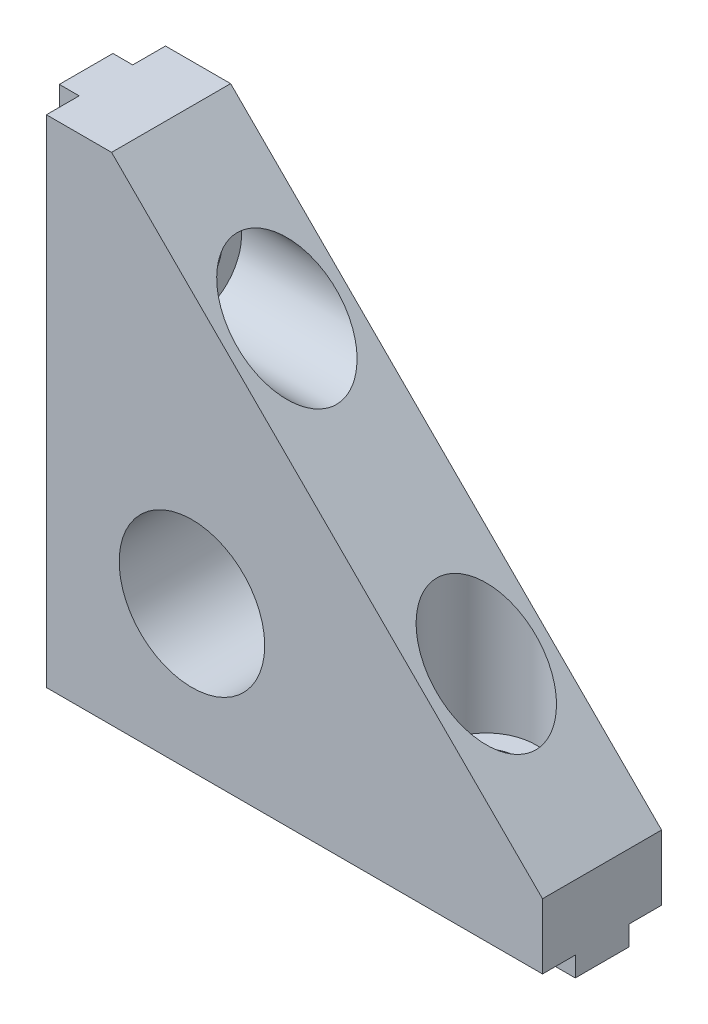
ISO-10303-21;
HEADER;
FILE_DESCRIPTION(('STEP AP214'),'2;1');
FILE_NAME('part.step','',(''),(''),'','','');
FILE_SCHEMA(('AUTOMOTIVE_DESIGN { 1 0 10303 214 1 1 1 1 }'));
ENDSEC;
DATA;
#1=APPLICATION_CONTEXT('core data for automotive mechanical design processes');
#2=APPLICATION_PROTOCOL_DEFINITION('international standard','automotive_design',2000,#1);
#3=PRODUCT_CONTEXT('',#1,'mechanical');
#4=PRODUCT('Part','Part','',(#3));
#5=PRODUCT_RELATED_PRODUCT_CATEGORY('part','',(#4));
#6=PRODUCT_DEFINITION_FORMATION('','',#4);
#7=PRODUCT_DEFINITION_CONTEXT('part definition',#1,'design');
#8=PRODUCT_DEFINITION('design','',#6,#7);
#9=PRODUCT_DEFINITION_SHAPE('','',#8);
#10=(LENGTH_UNIT() NAMED_UNIT(*) SI_UNIT(.MILLI.,.METRE.));
#11=(NAMED_UNIT(*) PLANE_ANGLE_UNIT() SI_UNIT($,.RADIAN.));
#12=(NAMED_UNIT(*) SI_UNIT($,.STERADIAN.) SOLID_ANGLE_UNIT());
#13=UNCERTAINTY_MEASURE_WITH_UNIT(LENGTH_MEASURE(1.E-05),#10,'distance_accuracy_value','');
#14=(GEOMETRIC_REPRESENTATION_CONTEXT(3) GLOBAL_UNCERTAINTY_ASSIGNED_CONTEXT((#13)) GLOBAL_UNIT_ASSIGNED_CONTEXT((#10,
#11,#12)) REPRESENTATION_CONTEXT('',''));
#15=CARTESIAN_POINT('',(0.,0.,0.));
#16=DIRECTION('',(0.,0.,1.));
#17=DIRECTION('',(1.,0.,0.));
#18=AXIS2_PLACEMENT_3D('',#15,#16,#17);
#19=CARTESIAN_POINT('',(53.,-25.,0.));
#20=DIRECTION('',(0.,-1.,0.));
#21=DIRECTION('',(0.,0.,-1.));
#22=AXIS2_PLACEMENT_3D('',#19,#20,#21);
#23=PLANE('',#22);
#24=DIRECTION('',(0.,0.,1.));
#25=VECTOR('',#24,1.);
#26=CARTESIAN_POINT('',(-19.,-25.,0.));
#27=LINE('',#26,#25);
#28=CARTESIAN_POINT('',(-19.,-25.,-4.05));
#29=VERTEX_POINT('',#28);
#30=CARTESIAN_POINT('',(-19.,-25.,4.05));
#31=VERTEX_POINT('',#30);
#32=EDGE_CURVE('E152',#29,#31,#27,.T.);
#33=ORIENTED_EDGE('',*,*,#32,.F.);
#34=DIRECTION('',(1.,0.,0.));
#35=VECTOR('',#34,1.);
#36=CARTESIAN_POINT('',(53.,-25.,-4.05));
#37=LINE('',#36,#35);
#38=CARTESIAN_POINT('',(33.5384954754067,-25.,-4.05));
#39=VERTEX_POINT('',#38);
#40=EDGE_CURVE('E138',#29,#39,#37,.T.);
#41=ORIENTED_EDGE('',*,*,#40,.T.);
#42=CARTESIAN_POINT('',(35.5,-25.,0.));
#43=DIRECTION('',(0.,1.,0.));
#44=DIRECTION('',(0.,0.,1.));
#45=AXIS2_PLACEMENT_3D('',#42,#43,#44);
#46=CIRCLE('',#45,4.5);
#47=CARTESIAN_POINT('',(33.5384954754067,-25.,4.05));
#48=VERTEX_POINT('',#47);
#49=EDGE_CURVE('E157',#39,#48,#46,.T.);
#50=ORIENTED_EDGE('',*,*,#49,.T.);
#51=DIRECTION('',(-1.,0.,0.));
#52=VECTOR('',#51,1.);
#53=CARTESIAN_POINT('',(53.,-25.,4.05));
#54=LINE('',#53,#52);
#55=EDGE_CURVE('E145',#48,#31,#54,.T.);
#56=ORIENTED_EDGE('',*,*,#55,.T.);
#57=EDGE_LOOP('',(#33,#41,#50,#56));
#58=FACE_BOUND('',#57,.T.);
#59=ADVANCED_FACE('F15',(#58),#23,.T.);
#60=CARTESIAN_POINT('',(53.,-25.,4.05));
#61=DIRECTION('',(0.,0.,-1.));
#62=DIRECTION('',(-1.,0.,0.));
#63=AXIS2_PLACEMENT_3D('',#60,#61,#62);
#64=PLANE('',#63);
#65=DIRECTION('',(1.,0.,0.));
#66=VECTOR('',#65,1.);
#67=CARTESIAN_POINT('',(53.,-22.,4.05));
#68=LINE('',#67,#66);
#69=CARTESIAN_POINT('',(33.5384954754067,-22.,4.05));
#70=VERTEX_POINT('',#69);
#71=CARTESIAN_POINT('',(-22.,-22.,4.05));
#72=VERTEX_POINT('',#71);
#73=EDGE_CURVE('E161',#70,#72,#68,.F.);
#74=ORIENTED_EDGE('',*,*,#73,.T.);
#75=DIRECTION('',(0.707106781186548,-0.707106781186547,0.));
#76=VECTOR('',#75,1.);
#77=CARTESIAN_POINT('',(-19.,-25.,4.05));
#78=LINE('',#77,#76);
#79=EDGE_CURVE('E151',#31,#72,#78,.F.);
#80=ORIENTED_EDGE('',*,*,#79,.F.);
#81=ORIENTED_EDGE('',*,*,#55,.F.);
#82=DIRECTION('',(0.,1.,0.));
#83=VECTOR('',#82,1.);
#84=CARTESIAN_POINT('',(33.5384954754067,-17.,4.05));
#85=LINE('',#84,#83);
#86=EDGE_CURVE('E149',#48,#70,#85,.T.);
#87=ORIENTED_EDGE('',*,*,#86,.T.);
#88=EDGE_LOOP('',(#74,#80,#81,#87));
#89=FACE_BOUND('',#88,.T.);
#90=ADVANCED_FACE('F148',(#89),#64,.F.);
#91=CARTESIAN_POINT('',(35.5,-9.,0.));
#92=DIRECTION('',(0.,1.,0.));
#93=DIRECTION('',(0.,0.,1.));
#94=AXIS2_PLACEMENT_3D('',#91,#92,#93);
#95=PLANE('',#94);
#96=CARTESIAN_POINT('',(35.5000000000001,-9.,0.));
#97=DIRECTION('',(0.,1.,0.));
#98=DIRECTION('',(0.,0.,1.));
#99=AXIS2_PLACEMENT_3D('',#96,#97,#98);
#100=CIRCLE('',#99,4.5);
#101=CARTESIAN_POINT('',(35.5000000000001,-9.00000000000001,4.50000000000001));
#102=VERTEX_POINT('',#101);
#103=EDGE_CURVE('E19',#102,#102,#100,.F.);
#104=ORIENTED_EDGE('',*,*,#103,.T.);
#105=EDGE_LOOP('',(#104));
#106=FACE_BOUND('',#105,.T.);
#107=CARTESIAN_POINT('',(35.5,-8.99999999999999,0.));
#108=DIRECTION('',(0.,1.,0.));
#109=DIRECTION('',(-1.,0.,0.));
#110=AXIS2_PLACEMENT_3D('',#107,#108,#109);
#111=CIRCLE('',#110,7.5);
#112=CARTESIAN_POINT('',(28.,-9.,0.));
#113=VERTEX_POINT('',#112);
#114=EDGE_CURVE('E172',#113,#113,#111,.T.);
#115=ORIENTED_EDGE('',*,*,#114,.T.);
#116=EDGE_LOOP('',(#115));
#117=FACE_BOUND('',#116,.T.);
#118=ADVANCED_FACE('F488',(#106,#117),#95,.T.);
#119=CARTESIAN_POINT('',(-19.,-25.,0.));
#120=DIRECTION('',(-0.707106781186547,-0.707106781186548,0.));
#121=DIRECTION('',(0.707106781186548,-0.707106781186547,0.));
#122=AXIS2_PLACEMENT_3D('',#119,#120,#121);
#123=PLANE('',#122);
#124=ORIENTED_EDGE('',*,*,#32,.T.);
#125=ORIENTED_EDGE('',*,*,#79,.T.);
#126=DIRECTION('',(-0.707106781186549,0.707106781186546,0.));
#127=VECTOR('',#126,1.);
#128=CARTESIAN_POINT('',(-22.,-22.,4.05));
#129=LINE('',#128,#127);
#130=CARTESIAN_POINT('',(-25.,-19.0000000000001,4.05));
#131=VERTEX_POINT('',#130);
#132=EDGE_CURVE('E250',#72,#131,#129,.T.);
#133=ORIENTED_EDGE('',*,*,#132,.T.);
#134=DIRECTION('',(0.,0.,1.));
#135=VECTOR('',#134,1.);
#136=CARTESIAN_POINT('',(-25.,-19.0000000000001,0.));
#137=LINE('',#136,#135);
#138=CARTESIAN_POINT('',(-25.,-19.,-4.05));
#139=VERTEX_POINT('',#138);
#140=EDGE_CURVE('E219',#139,#131,#137,.T.);
#141=ORIENTED_EDGE('',*,*,#140,.F.);
#142=DIRECTION('',(0.707106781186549,-0.707106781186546,0.));
#143=VECTOR('',#142,1.);
#144=CARTESIAN_POINT('',(-25.,-19.0000000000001,-4.05));
#145=LINE('',#144,#143);
#146=CARTESIAN_POINT('',(-22.,-22.,-4.05));
#147=VERTEX_POINT('',#146);
#148=EDGE_CURVE('E261',#139,#147,#145,.T.);
#149=ORIENTED_EDGE('',*,*,#148,.T.);
#150=DIRECTION('',(0.70710678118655,-0.707106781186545,0.));
#151=VECTOR('',#150,1.);
#152=CARTESIAN_POINT('',(-22.,-22.,-4.05));
#153=LINE('',#152,#151);
#154=EDGE_CURVE('E221',#147,#29,#153,.T.);
#155=ORIENTED_EDGE('',*,*,#154,.T.);
#156=EDGE_LOOP('',(#124,#125,#133,#141,#149,#155));
#157=FACE_BOUND('',#156,.T.);
#158=ADVANCED_FACE('F381',(#157),#123,.T.);
#159=CARTESIAN_POINT('',(-9.00000000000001,35.5,0.));
#160=DIRECTION('',(1.,0.,0.));
#161=DIRECTION('',(0.,0.,-1.));
#162=AXIS2_PLACEMENT_3D('',#159,#160,#161);
#163=PLANE('',#162);
#164=CARTESIAN_POINT('',(-9.00000000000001,35.5,0.));
#165=DIRECTION('',(1.,0.,0.));
#166=DIRECTION('',(0.,1.,0.));
#167=AXIS2_PLACEMENT_3D('',#164,#165,#166);
#168=CIRCLE('',#167,4.5);
#169=CARTESIAN_POINT('',(-9.00000000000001,40.,0.));
#170=VERTEX_POINT('',#169);
#171=EDGE_CURVE('E180',#170,#170,#168,.F.);
#172=ORIENTED_EDGE('',*,*,#171,.T.);
#173=EDGE_LOOP('',(#172));
#174=FACE_BOUND('',#173,.T.);
#175=CARTESIAN_POINT('',(-9.00000000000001,35.5,0.));
#176=DIRECTION('',(1.,0.,0.));
#177=DIRECTION('',(0.,1.,0.));
#178=AXIS2_PLACEMENT_3D('',#175,#176,#177);
#179=CIRCLE('',#178,7.5);
#180=CARTESIAN_POINT('',(-9.00000000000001,43.,0.));
#181=VERTEX_POINT('',#180);
#182=EDGE_CURVE('E175',#181,#181,#179,.T.);
#183=ORIENTED_EDGE('',*,*,#182,.T.);
#184=EDGE_LOOP('',(#183));
#185=FACE_BOUND('',#184,.T.);
#186=ADVANCED_FACE('F416',(#174,#185),#163,.T.);
#187=CARTESIAN_POINT('',(-25.,-19.,0.));
#188=DIRECTION('',(-1.,0.,0.));
#189=DIRECTION('',(0.,0.,1.));
#190=AXIS2_PLACEMENT_3D('',#187,#188,#189);
#191=PLANE('',#190);
#192=ORIENTED_EDGE('',*,*,#140,.T.);
#193=DIRECTION('',(0.,1.,0.));
#194=VECTOR('',#193,1.);
#195=CARTESIAN_POINT('',(-25.,53.,4.05));
#196=LINE('',#195,#194);
#197=CARTESIAN_POINT('',(-25.,33.5384954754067,4.05));
#198=VERTEX_POINT('',#197);
#199=EDGE_CURVE('E253',#131,#198,#196,.T.);
#200=ORIENTED_EDGE('',*,*,#199,.T.);
#201=CARTESIAN_POINT('',(-25.,35.5,0.));
#202=DIRECTION('',(1.,0.,0.));
#203=DIRECTION('',(0.,1.,0.));
#204=AXIS2_PLACEMENT_3D('',#201,#202,#203);
#205=CIRCLE('',#204,4.5);
#206=CARTESIAN_POINT('',(-25.,33.5384954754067,-4.05));
#207=VERTEX_POINT('',#206);
#208=EDGE_CURVE('E183',#198,#207,#205,.T.);
#209=ORIENTED_EDGE('',*,*,#208,.T.);
#210=DIRECTION('',(0.,1.,0.));
#211=VECTOR('',#210,1.);
#212=CARTESIAN_POINT('',(-25.,53.,-4.05));
#213=LINE('',#212,#211);
#214=EDGE_CURVE('E258',#207,#139,#213,.F.);
#215=ORIENTED_EDGE('',*,*,#214,.T.);
#216=EDGE_LOOP('',(#192,#200,#209,#215));
#217=FACE_BOUND('',#216,.T.);
#218=ADVANCED_FACE('F414',(#217),#191,.T.);
#219=CARTESIAN_POINT('',(-22.,53.,4.05));
#220=DIRECTION('',(0.,0.,-1.));
#221=DIRECTION('',(-1.,0.,0.));
#222=AXIS2_PLACEMENT_3D('',#219,#220,#221);
#223=PLANE('',#222);
#224=ORIENTED_EDGE('',*,*,#199,.F.);
#225=ORIENTED_EDGE('',*,*,#132,.F.);
#226=DIRECTION('',(0.,1.,0.));
#227=VECTOR('',#226,1.);
#228=CARTESIAN_POINT('',(-22.,53.,4.05));
#229=LINE('',#228,#227);
#230=CARTESIAN_POINT('',(-22.,33.5384954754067,4.05));
#231=VERTEX_POINT('',#230);
#232=EDGE_CURVE('E249',#72,#231,#229,.T.);
#233=ORIENTED_EDGE('',*,*,#232,.T.);
#234=DIRECTION('',(-1.,0.,0.));
#235=VECTOR('',#234,1.);
#236=CARTESIAN_POINT('',(-17.,33.5384954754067,4.05));
#237=LINE('',#236,#235);
#238=EDGE_CURVE('E196',#231,#198,#237,.T.);
#239=ORIENTED_EDGE('',*,*,#238,.T.);
#240=EDGE_LOOP('',(#224,#225,#233,#239));
#241=FACE_BOUND('',#240,.T.);
#242=ADVANCED_FACE('F412',(#241),#223,.F.);
#243=CARTESIAN_POINT('',(53.,-22.,-4.05));
#244=DIRECTION('',(0.,0.,1.));
#245=DIRECTION('',(1.,0.,0.));
#246=AXIS2_PLACEMENT_3D('',#243,#244,#245);
#247=PLANE('',#246);
#248=ORIENTED_EDGE('',*,*,#40,.F.);
#249=ORIENTED_EDGE('',*,*,#154,.F.);
#250=DIRECTION('',(1.,0.,0.));
#251=VECTOR('',#250,1.);
#252=CARTESIAN_POINT('',(53.,-22.,-4.05));
#253=LINE('',#252,#251);
#254=CARTESIAN_POINT('',(33.5384954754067,-22.,-4.05));
#255=VERTEX_POINT('',#254);
#256=EDGE_CURVE('E201',#147,#255,#253,.T.);
#257=ORIENTED_EDGE('',*,*,#256,.T.);
#258=DIRECTION('',(0.,-1.,0.));
#259=VECTOR('',#258,1.);
#260=CARTESIAN_POINT('',(33.5384954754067,-17.,-4.05));
#261=LINE('',#260,#259);
#262=EDGE_CURVE('E163',#255,#39,#261,.T.);
#263=ORIENTED_EDGE('',*,*,#262,.T.);
#264=EDGE_LOOP('',(#248,#249,#257,#263));
#265=FACE_BOUND('',#264,.T.);
#266=ADVANCED_FACE('F379',(#265),#247,.F.);
#267=CARTESIAN_POINT('',(35.5,-25.,0.));
#268=DIRECTION('',(0.,1.,0.));
#269=DIRECTION('',(0.,0.,1.));
#270=AXIS2_PLACEMENT_3D('',#267,#268,#269);
#271=CYLINDRICAL_SURFACE('',#270,4.5);
#272=CARTESIAN_POINT('',(35.5,-22.,0.));
#273=DIRECTION('',(0.,1.,0.));
#274=DIRECTION('',(0.,0.,1.));
#275=AXIS2_PLACEMENT_3D('',#272,#273,#274);
#276=CIRCLE('',#275,4.5);
#277=CARTESIAN_POINT('',(37.4615045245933,-22.,4.05));
#278=VERTEX_POINT('',#277);
#279=EDGE_CURVE('E160',#278,#70,#276,.F.);
#280=ORIENTED_EDGE('',*,*,#279,.T.);
#281=ORIENTED_EDGE('',*,*,#86,.F.);
#282=ORIENTED_EDGE('',*,*,#49,.F.);
#283=ORIENTED_EDGE('',*,*,#262,.F.);
#284=CARTESIAN_POINT('',(35.5,-22.,0.));
#285=DIRECTION('',(0.,1.,0.));
#286=DIRECTION('',(0.,0.,1.));
#287=AXIS2_PLACEMENT_3D('',#284,#285,#286);
#288=CIRCLE('',#287,4.5);
#289=CARTESIAN_POINT('',(37.4615045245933,-22.,-4.05));
#290=VERTEX_POINT('',#289);
#291=EDGE_CURVE('E197',#255,#290,#288,.F.);
#292=ORIENTED_EDGE('',*,*,#291,.T.);
#293=DIRECTION('',(0.,1.,0.));
#294=VECTOR('',#293,1.);
#295=CARTESIAN_POINT('',(37.4615045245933,-22.,-4.05));
#296=LINE('',#295,#294);
#297=CARTESIAN_POINT('',(37.4615045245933,-25.,-4.05));
#298=VERTEX_POINT('',#297);
#299=EDGE_CURVE('E176',#290,#298,#296,.F.);
#300=ORIENTED_EDGE('',*,*,#299,.T.);
#301=CARTESIAN_POINT('',(35.5,-25.,0.));
#302=DIRECTION('',(0.,1.,0.));
#303=DIRECTION('',(0.,0.,1.));
#304=AXIS2_PLACEMENT_3D('',#301,#302,#303);
#305=CIRCLE('',#304,4.5);
#306=CARTESIAN_POINT('',(37.4615045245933,-25.,4.05));
#307=VERTEX_POINT('',#306);
#308=EDGE_CURVE('E168',#307,#298,#305,.T.);
#309=ORIENTED_EDGE('',*,*,#308,.F.);
#310=DIRECTION('',(0.,1.,0.));
#311=VECTOR('',#310,1.);
#312=CARTESIAN_POINT('',(37.4615045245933,-25.,4.05));
#313=LINE('',#312,#311);
#314=EDGE_CURVE('E171',#307,#278,#313,.T.);
#315=ORIENTED_EDGE('',*,*,#314,.T.);
#316=EDGE_LOOP('',(#280,#281,#282,#283,#292,#300,#309,#315));
#317=FACE_BOUND('',#316,.T.);
#318=ORIENTED_EDGE('',*,*,#103,.F.);
#319=EDGE_LOOP('',(#318));
#320=FACE_BOUND('',#319,.T.);
#321=ADVANCED_FACE('F155',(#317,#320),#271,.F.);
#322=CARTESIAN_POINT('',(53.,-22.,4.05));
#323=DIRECTION('',(0.,1.,0.));
#324=DIRECTION('',(0.,0.,1.));
#325=AXIS2_PLACEMENT_3D('',#322,#323,#324);
#326=PLANE('',#325);
#327=DIRECTION('',(-1.,0.,0.));
#328=VECTOR('',#327,1.);
#329=CARTESIAN_POINT('',(53.,-22.,4.05));
#330=LINE('',#329,#328);
#331=CARTESIAN_POINT('',(53.,-22.,4.05));
#332=VERTEX_POINT('',#331);
#333=EDGE_CURVE('E167',#278,#332,#330,.F.);
#334=ORIENTED_EDGE('',*,*,#333,.T.);
#335=DIRECTION('',(0.,0.,-1.));
#336=VECTOR('',#335,1.);
#337=CARTESIAN_POINT('',(53.,-22.,0.));
#338=LINE('',#337,#336);
#339=CARTESIAN_POINT('',(53.,-22.,9.));
#340=VERTEX_POINT('',#339);
#341=EDGE_CURVE('E200',#340,#332,#338,.T.);
#342=ORIENTED_EDGE('',*,*,#341,.F.);
#343=DIRECTION('',(1.,0.,0.));
#344=VECTOR('',#343,1.);
#345=CARTESIAN_POINT('',(5.77669301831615,-22.,9.));
#346=LINE('',#345,#344);
#347=CARTESIAN_POINT('',(-22.,-22.,9.));
#348=VERTEX_POINT('',#347);
#349=EDGE_CURVE('E239',#348,#340,#346,.T.);
#350=ORIENTED_EDGE('',*,*,#349,.F.);
#351=DIRECTION('',(0.,0.,-1.));
#352=VECTOR('',#351,1.);
#353=CARTESIAN_POINT('',(-22.,-22.,9.));
#354=LINE('',#353,#352);
#355=EDGE_CURVE('E246',#348,#72,#354,.T.);
#356=ORIENTED_EDGE('',*,*,#355,.T.);
#357=ORIENTED_EDGE('',*,*,#73,.F.);
#358=ORIENTED_EDGE('',*,*,#279,.F.);
#359=EDGE_LOOP('',(#334,#342,#350,#356,#357,#358));
#360=FACE_BOUND('',#359,.T.);
#361=ADVANCED_FACE('F365',(#360),#326,.F.);
#362=CARTESIAN_POINT('',(53.,-25.,4.05));
#363=DIRECTION('',(0.,0.,-1.));
#364=DIRECTION('',(-1.,0.,0.));
#365=AXIS2_PLACEMENT_3D('',#362,#363,#364);
#366=PLANE('',#365);
#367=DIRECTION('',(1.,0.,0.));
#368=VECTOR('',#367,1.);
#369=CARTESIAN_POINT('',(53.,-25.,4.05));
#370=LINE('',#369,#368);
#371=CARTESIAN_POINT('',(53.,-25.,4.05));
#372=VERTEX_POINT('',#371);
#373=EDGE_CURVE('E170',#372,#307,#370,.F.);
#374=ORIENTED_EDGE('',*,*,#373,.F.);
#375=DIRECTION('',(0.,1.,0.));
#376=VECTOR('',#375,1.);
#377=CARTESIAN_POINT('',(53.,-12.15,4.05));
#378=LINE('',#377,#376);
#379=EDGE_CURVE('E224',#332,#372,#378,.F.);
#380=ORIENTED_EDGE('',*,*,#379,.F.);
#381=ORIENTED_EDGE('',*,*,#333,.F.);
#382=ORIENTED_EDGE('',*,*,#314,.F.);
#383=EDGE_LOOP('',(#374,#380,#381,#382));
#384=FACE_BOUND('',#383,.T.);
#385=ADVANCED_FACE('F370',(#384),#366,.F.);
#386=CARTESIAN_POINT('',(53.,-25.,0.));
#387=DIRECTION('',(0.,-1.,0.));
#388=DIRECTION('',(0.,0.,-1.));
#389=AXIS2_PLACEMENT_3D('',#386,#387,#388);
#390=PLANE('',#389);
#391=DIRECTION('',(0.,0.,-1.));
#392=VECTOR('',#391,1.);
#393=CARTESIAN_POINT('',(53.,-25.,0.));
#394=LINE('',#393,#392);
#395=CARTESIAN_POINT('',(53.,-25.,-4.05));
#396=VERTEX_POINT('',#395);
#397=EDGE_CURVE('E228',#372,#396,#394,.T.);
#398=ORIENTED_EDGE('',*,*,#397,.F.);
#399=ORIENTED_EDGE('',*,*,#373,.T.);
#400=ORIENTED_EDGE('',*,*,#308,.T.);
#401=DIRECTION('',(1.,0.,0.));
#402=VECTOR('',#401,1.);
#403=CARTESIAN_POINT('',(53.,-25.,-4.05));
#404=LINE('',#403,#402);
#405=EDGE_CURVE('E232',#298,#396,#404,.T.);
#406=ORIENTED_EDGE('',*,*,#405,.T.);
#407=EDGE_LOOP('',(#398,#399,#400,#406));
#408=FACE_BOUND('',#407,.T.);
#409=ADVANCED_FACE('F374',(#408),#390,.T.);
#410=CARTESIAN_POINT('',(53.,-22.,-4.05));
#411=DIRECTION('',(0.,0.,1.));
#412=DIRECTION('',(1.,0.,0.));
#413=AXIS2_PLACEMENT_3D('',#410,#411,#412);
#414=PLANE('',#413);
#415=DIRECTION('',(1.,0.,0.));
#416=VECTOR('',#415,1.);
#417=CARTESIAN_POINT('',(53.,-22.,-4.05));
#418=LINE('',#417,#416);
#419=CARTESIAN_POINT('',(53.,-22.,-4.05));
#420=VERTEX_POINT('',#419);
#421=EDGE_CURVE('E242',#290,#420,#418,.T.);
#422=ORIENTED_EDGE('',*,*,#421,.T.);
#423=DIRECTION('',(0.,1.,0.));
#424=VECTOR('',#423,1.);
#425=CARTESIAN_POINT('',(53.,-12.15,-4.05));
#426=LINE('',#425,#424);
#427=EDGE_CURVE('E231',#396,#420,#426,.T.);
#428=ORIENTED_EDGE('',*,*,#427,.F.);
#429=ORIENTED_EDGE('',*,*,#405,.F.);
#430=ORIENTED_EDGE('',*,*,#299,.F.);
#431=EDGE_LOOP('',(#422,#428,#429,#430));
#432=FACE_BOUND('',#431,.T.);
#433=ADVANCED_FACE('F377',(#432),#414,.F.);
#434=CARTESIAN_POINT('',(35.5,-9.,0.));
#435=DIRECTION('',(0.,1.,0.));
#436=DIRECTION('',(-1.,0.,0.));
#437=AXIS2_PLACEMENT_3D('',#434,#435,#436);
#438=CYLINDRICAL_SURFACE('',#437,7.5);
#439=ORIENTED_EDGE('',*,*,#114,.F.);
#440=EDGE_LOOP('',(#439));
#441=FACE_BOUND('',#440,.T.);
#442=CARTESIAN_POINT('',(35.5,5.35000000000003,0.));
#443=DIRECTION('',(0.707106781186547,0.707106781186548,0.));
#444=DIRECTION('',(-0.707106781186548,0.707106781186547,0.));
#445=AXIS2_PLACEMENT_3D('',#442,#443,#444);
#446=ELLIPSE('',#445,10.6066017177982,7.5);
#447=CARTESIAN_POINT('',(28.,12.85,0.));
#448=VERTEX_POINT('',#447);
#449=EDGE_CURVE('E202',#448,#448,#446,.F.);
#450=ORIENTED_EDGE('',*,*,#449,.F.);
#451=EDGE_LOOP('',(#450));
#452=FACE_BOUND('',#451,.T.);
#453=ADVANCED_FACE('F464',(#441,#452),#438,.F.);
#454=CARTESIAN_POINT('',(-9.00000000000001,35.5,0.));
#455=DIRECTION('',(1.,0.,0.));
#456=DIRECTION('',(0.,1.,0.));
#457=AXIS2_PLACEMENT_3D('',#454,#455,#456);
#458=CYLINDRICAL_SURFACE('',#457,7.5);
#459=ORIENTED_EDGE('',*,*,#182,.F.);
#460=EDGE_LOOP('',(#459));
#461=FACE_BOUND('',#460,.T.);
#462=CARTESIAN_POINT('',(5.35000000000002,35.5,0.));
#463=DIRECTION('',(0.707106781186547,0.707106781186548,0.));
#464=DIRECTION('',(0.707106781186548,-0.707106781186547,0.));
#465=AXIS2_PLACEMENT_3D('',#462,#463,#464);
#466=ELLIPSE('',#465,10.6066017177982,7.5);
#467=CARTESIAN_POINT('',(12.85,28.,0.));
#468=VERTEX_POINT('',#467);
#469=EDGE_CURVE('E205',#468,#468,#466,.F.);
#470=ORIENTED_EDGE('',*,*,#469,.F.);
#471=EDGE_LOOP('',(#470));
#472=FACE_BOUND('',#471,.T.);
#473=ADVANCED_FACE('F461',(#461,#472),#458,.F.);
#474=CARTESIAN_POINT('',(-22.,53.,4.05));
#475=DIRECTION('',(0.,0.,-1.));
#476=DIRECTION('',(-1.,0.,0.));
#477=AXIS2_PLACEMENT_3D('',#474,#475,#476);
#478=PLANE('',#477);
#479=DIRECTION('',(0.,1.,0.));
#480=VECTOR('',#479,1.);
#481=CARTESIAN_POINT('',(-22.,53.,4.05));
#482=LINE('',#481,#480);
#483=CARTESIAN_POINT('',(-22.,37.4615045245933,4.05));
#484=VERTEX_POINT('',#483);
#485=CARTESIAN_POINT('',(-22.,53.,4.05));
#486=VERTEX_POINT('',#485);
#487=EDGE_CURVE('E179',#484,#486,#482,.T.);
#488=ORIENTED_EDGE('',*,*,#487,.T.);
#489=DIRECTION('',(1.,0.,0.));
#490=VECTOR('',#489,1.);
#491=CARTESIAN_POINT('',(-25.,53.,4.05));
#492=LINE('',#491,#490);
#493=CARTESIAN_POINT('',(-25.,53.,4.05));
#494=VERTEX_POINT('',#493);
#495=EDGE_CURVE('E209',#494,#486,#492,.T.);
#496=ORIENTED_EDGE('',*,*,#495,.F.);
#497=DIRECTION('',(0.,1.,0.));
#498=VECTOR('',#497,1.);
#499=CARTESIAN_POINT('',(-25.,-19.,4.05));
#500=LINE('',#499,#498);
#501=CARTESIAN_POINT('',(-25.,37.4615045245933,4.05));
#502=VERTEX_POINT('',#501);
#503=EDGE_CURVE('E262',#502,#494,#500,.T.);
#504=ORIENTED_EDGE('',*,*,#503,.F.);
#505=DIRECTION('',(1.,0.,0.));
#506=VECTOR('',#505,1.);
#507=CARTESIAN_POINT('',(-17.,37.4615045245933,4.05));
#508=LINE('',#507,#506);
#509=EDGE_CURVE('E191',#502,#484,#508,.T.);
#510=ORIENTED_EDGE('',*,*,#509,.T.);
#511=EDGE_LOOP('',(#488,#496,#504,#510));
#512=FACE_BOUND('',#511,.T.);
#513=ADVANCED_FACE('F402',(#512),#478,.F.);
#514=CARTESIAN_POINT('',(-22.,53.,9.));
#515=DIRECTION('',(1.,0.,0.));
#516=DIRECTION('',(0.,0.,-1.));
#517=AXIS2_PLACEMENT_3D('',#514,#515,#516);
#518=PLANE('',#517);
#519=ORIENTED_EDGE('',*,*,#232,.F.);
#520=ORIENTED_EDGE('',*,*,#355,.F.);
#521=DIRECTION('',(0.,1.,0.));
#522=VECTOR('',#521,1.);
#523=CARTESIAN_POINT('',(-22.,5.77669301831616,9.));
#524=LINE('',#523,#522);
#525=CARTESIAN_POINT('',(-22.,53.,9.));
#526=VERTEX_POINT('',#525);
#527=EDGE_CURVE('E243',#526,#348,#524,.F.);
#528=ORIENTED_EDGE('',*,*,#527,.F.);
#529=DIRECTION('',(0.,0.,1.));
#530=VECTOR('',#529,1.);
#531=CARTESIAN_POINT('',(-22.,53.,0.));
#532=LINE('',#531,#530);
#533=EDGE_CURVE('E235',#486,#526,#532,.T.);
#534=ORIENTED_EDGE('',*,*,#533,.F.);
#535=ORIENTED_EDGE('',*,*,#487,.F.);
#536=CARTESIAN_POINT('',(-22.,35.5,0.));
#537=DIRECTION('',(1.,0.,0.));
#538=DIRECTION('',(0.,1.,0.));
#539=AXIS2_PLACEMENT_3D('',#536,#537,#538);
#540=CIRCLE('',#539,4.5);
#541=EDGE_CURVE('E193',#484,#231,#540,.T.);
#542=ORIENTED_EDGE('',*,*,#541,.T.);
#543=EDGE_LOOP('',(#519,#520,#528,#534,#535,#542));
#544=FACE_BOUND('',#543,.T.);
#545=ADVANCED_FACE('F406',(#544),#518,.F.);
#546=CARTESIAN_POINT('',(-25.,-19.,0.));
#547=DIRECTION('',(-1.,0.,0.));
#548=DIRECTION('',(0.,0.,1.));
#549=AXIS2_PLACEMENT_3D('',#546,#547,#548);
#550=PLANE('',#549);
#551=DIRECTION('',(0.,0.,1.));
#552=VECTOR('',#551,1.);
#553=CARTESIAN_POINT('',(-25.,53.,0.));
#554=LINE('',#553,#552);
#555=CARTESIAN_POINT('',(-25.,53.,-4.05));
#556=VERTEX_POINT('',#555);
#557=EDGE_CURVE('E282',#556,#494,#554,.T.);
#558=ORIENTED_EDGE('',*,*,#557,.F.);
#559=DIRECTION('',(0.,1.,0.));
#560=VECTOR('',#559,1.);
#561=CARTESIAN_POINT('',(-25.,53.,-4.05));
#562=LINE('',#561,#560);
#563=CARTESIAN_POINT('',(-25.,37.4615045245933,-4.05));
#564=VERTEX_POINT('',#563);
#565=EDGE_CURVE('E184',#556,#564,#562,.F.);
#566=ORIENTED_EDGE('',*,*,#565,.T.);
#567=CARTESIAN_POINT('',(-25.,35.5,0.));
#568=DIRECTION('',(1.,0.,0.));
#569=DIRECTION('',(0.,1.,0.));
#570=AXIS2_PLACEMENT_3D('',#567,#568,#569);
#571=CIRCLE('',#570,4.5);
#572=EDGE_CURVE('E188',#564,#502,#571,.T.);
#573=ORIENTED_EDGE('',*,*,#572,.T.);
#574=ORIENTED_EDGE('',*,*,#503,.T.);
#575=EDGE_LOOP('',(#558,#566,#573,#574));
#576=FACE_BOUND('',#575,.T.);
#577=ADVANCED_FACE('F399',(#576),#550,.T.);
#578=CARTESIAN_POINT('',(-25.,53.,-4.05));
#579=DIRECTION('',(0.,0.,1.));
#580=DIRECTION('',(1.,0.,0.));
#581=AXIS2_PLACEMENT_3D('',#578,#579,#580);
#582=PLANE('',#581);
#583=DIRECTION('',(0.,1.,0.));
#584=VECTOR('',#583,1.);
#585=CARTESIAN_POINT('',(-22.,53.,-4.05));
#586=LINE('',#585,#584);
#587=CARTESIAN_POINT('',(-22.,33.5384954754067,-4.05));
#588=VERTEX_POINT('',#587);
#589=EDGE_CURVE('E285',#588,#147,#586,.F.);
#590=ORIENTED_EDGE('',*,*,#589,.T.);
#591=ORIENTED_EDGE('',*,*,#148,.F.);
#592=ORIENTED_EDGE('',*,*,#214,.F.);
#593=DIRECTION('',(1.,0.,0.));
#594=VECTOR('',#593,1.);
#595=CARTESIAN_POINT('',(-17.,33.5384954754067,-4.05));
#596=LINE('',#595,#594);
#597=EDGE_CURVE('E187',#207,#588,#596,.T.);
#598=ORIENTED_EDGE('',*,*,#597,.T.);
#599=EDGE_LOOP('',(#590,#591,#592,#598));
#600=FACE_BOUND('',#599,.T.);
#601=ADVANCED_FACE('F386',(#600),#582,.F.);
#602=CARTESIAN_POINT('',(-25.,53.,-4.05));
#603=DIRECTION('',(0.,0.,1.));
#604=DIRECTION('',(1.,0.,0.));
#605=AXIS2_PLACEMENT_3D('',#602,#603,#604);
#606=PLANE('',#605);
#607=ORIENTED_EDGE('',*,*,#565,.F.);
#608=DIRECTION('',(1.,0.,0.));
#609=VECTOR('',#608,1.);
#610=CARTESIAN_POINT('',(-25.,53.,-4.05));
#611=LINE('',#610,#609);
#612=CARTESIAN_POINT('',(-22.,53.,-4.05));
#613=VERTEX_POINT('',#612);
#614=EDGE_CURVE('E286',#613,#556,#611,.F.);
#615=ORIENTED_EDGE('',*,*,#614,.F.);
#616=DIRECTION('',(0.,1.,0.));
#617=VECTOR('',#616,1.);
#618=CARTESIAN_POINT('',(-22.,53.,-4.05));
#619=LINE('',#618,#617);
#620=CARTESIAN_POINT('',(-22.,37.4615045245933,-4.05));
#621=VERTEX_POINT('',#620);
#622=EDGE_CURVE('E214',#613,#621,#619,.F.);
#623=ORIENTED_EDGE('',*,*,#622,.T.);
#624=DIRECTION('',(-1.,0.,0.));
#625=VECTOR('',#624,1.);
#626=CARTESIAN_POINT('',(-17.,37.4615045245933,-4.05000000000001));
#627=LINE('',#626,#625);
#628=EDGE_CURVE('E192',#621,#564,#627,.T.);
#629=ORIENTED_EDGE('',*,*,#628,.T.);
#630=EDGE_LOOP('',(#607,#615,#623,#629));
#631=FACE_BOUND('',#630,.T.);
#632=ADVANCED_FACE('F393',(#631),#606,.F.);
#633=CARTESIAN_POINT('',(-25.,35.5,0.));
#634=DIRECTION('',(1.,0.,0.));
#635=DIRECTION('',(0.,1.,0.));
#636=AXIS2_PLACEMENT_3D('',#633,#634,#635);
#637=CYLINDRICAL_SURFACE('',#636,4.5);
#638=ORIENTED_EDGE('',*,*,#541,.F.);
#639=ORIENTED_EDGE('',*,*,#509,.F.);
#640=ORIENTED_EDGE('',*,*,#572,.F.);
#641=ORIENTED_EDGE('',*,*,#628,.F.);
#642=CARTESIAN_POINT('',(-22.,35.5,0.));
#643=DIRECTION('',(1.,0.,0.));
#644=DIRECTION('',(0.,1.,0.));
#645=AXIS2_PLACEMENT_3D('',#642,#643,#644);
#646=CIRCLE('',#645,4.5);
#647=EDGE_CURVE('E210',#621,#588,#646,.F.);
#648=ORIENTED_EDGE('',*,*,#647,.T.);
#649=ORIENTED_EDGE('',*,*,#597,.F.);
#650=ORIENTED_EDGE('',*,*,#208,.F.);
#651=ORIENTED_EDGE('',*,*,#238,.F.);
#652=EDGE_LOOP('',(#638,#639,#640,#641,#648,#649,#650,#651));
#653=FACE_BOUND('',#652,.T.);
#654=ORIENTED_EDGE('',*,*,#171,.F.);
#655=EDGE_LOOP('',(#654));
#656=FACE_BOUND('',#655,.T.);
#657=ADVANCED_FACE('F17',(#653,#656),#637,.F.);
#658=CARTESIAN_POINT('',(5.77669301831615,5.77669301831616,9.));
#659=DIRECTION('',(0.,0.,1.));
#660=DIRECTION('',(1.,0.,0.));
#661=AXIS2_PLACEMENT_3D('',#658,#659,#660);
#662=PLANE('',#661);
#663=CARTESIAN_POINT('',(0.,0.,9.));
#664=DIRECTION('',(0.,0.,1.));
#665=DIRECTION('',(1.,0.,0.));
#666=AXIS2_PLACEMENT_3D('',#663,#664,#665);
#667=CIRCLE('',#666,11.);
#668=CARTESIAN_POINT('',(11.,0.,9.));
#669=VERTEX_POINT('',#668);
#670=EDGE_CURVE('E213',#669,#669,#667,.F.);
#671=ORIENTED_EDGE('',*,*,#670,.T.);
#672=EDGE_LOOP('',(#671));
#673=FACE_BOUND('',#672,.T.);
#674=DIRECTION('',(-0.707106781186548,0.707106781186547,0.));
#675=VECTOR('',#674,1.);
#676=CARTESIAN_POINT('',(-12.15,53.,9.));
#677=LINE('',#676,#675);
#678=CARTESIAN_POINT('',(-12.15,53.,9.));
#679=VERTEX_POINT('',#678);
#680=CARTESIAN_POINT('',(53.,-12.15,9.));
#681=VERTEX_POINT('',#680);
#682=EDGE_CURVE('E313',#679,#681,#677,.F.);
#683=ORIENTED_EDGE('',*,*,#682,.F.);
#684=DIRECTION('',(1.,0.,0.));
#685=VECTOR('',#684,1.);
#686=CARTESIAN_POINT('',(-25.,53.,9.));
#687=LINE('',#686,#685);
#688=EDGE_CURVE('E238',#526,#679,#687,.T.);
#689=ORIENTED_EDGE('',*,*,#688,.F.);
#690=ORIENTED_EDGE('',*,*,#527,.T.);
#691=ORIENTED_EDGE('',*,*,#349,.T.);
#692=DIRECTION('',(0.,1.,0.));
#693=VECTOR('',#692,1.);
#694=CARTESIAN_POINT('',(53.,-12.15,9.));
#695=LINE('',#694,#693);
#696=EDGE_CURVE('E270',#681,#340,#695,.F.);
#697=ORIENTED_EDGE('',*,*,#696,.F.);
#698=EDGE_LOOP('',(#683,#689,#690,#691,#697));
#699=FACE_BOUND('',#698,.T.);
#700=ADVANCED_FACE('F361',(#673,#699),#662,.T.);
#701=CARTESIAN_POINT('',(53.,-22.,-9.));
#702=DIRECTION('',(0.,1.,0.));
#703=DIRECTION('',(0.,0.,1.));
#704=AXIS2_PLACEMENT_3D('',#701,#702,#703);
#705=PLANE('',#704);
#706=ORIENTED_EDGE('',*,*,#256,.F.);
#707=DIRECTION('',(0.,0.,-1.));
#708=VECTOR('',#707,1.);
#709=CARTESIAN_POINT('',(-22.,-22.,-4.05));
#710=LINE('',#709,#708);
#711=CARTESIAN_POINT('',(-22.,-22.,-9.));
#712=VERTEX_POINT('',#711);
#713=EDGE_CURVE('E289',#147,#712,#710,.T.);
#714=ORIENTED_EDGE('',*,*,#713,.T.);
#715=DIRECTION('',(1.,0.,0.));
#716=VECTOR('',#715,1.);
#717=CARTESIAN_POINT('',(5.77669301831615,-22.,-9.));
#718=LINE('',#717,#716);
#719=CARTESIAN_POINT('',(53.,-22.,-9.));
#720=VERTEX_POINT('',#719);
#721=EDGE_CURVE('E216',#712,#720,#718,.T.);
#722=ORIENTED_EDGE('',*,*,#721,.T.);
#723=DIRECTION('',(0.,0.,-1.));
#724=VECTOR('',#723,1.);
#725=CARTESIAN_POINT('',(53.,-22.,0.));
#726=LINE('',#725,#724);
#727=EDGE_CURVE('E267',#420,#720,#726,.T.);
#728=ORIENTED_EDGE('',*,*,#727,.F.);
#729=ORIENTED_EDGE('',*,*,#421,.F.);
#730=ORIENTED_EDGE('',*,*,#291,.F.);
#731=EDGE_LOOP('',(#706,#714,#722,#728,#729,#730));
#732=FACE_BOUND('',#731,.T.);
#733=ADVANCED_FACE('F351',(#732),#705,.F.);
#734=CARTESIAN_POINT('',(53.,-12.15,0.));
#735=DIRECTION('',(1.,0.,0.));
#736=DIRECTION('',(0.,0.,-1.));
#737=AXIS2_PLACEMENT_3D('',#734,#735,#736);
#738=PLANE('',#737);
#739=DIRECTION('',(0.,0.,1.));
#740=VECTOR('',#739,1.);
#741=CARTESIAN_POINT('',(53.,-12.1499999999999,0.));
#742=LINE('',#741,#740);
#743=CARTESIAN_POINT('',(53.,-12.15,-9.));
#744=VERTEX_POINT('',#743);
#745=EDGE_CURVE('E206',#681,#744,#742,.F.);
#746=ORIENTED_EDGE('',*,*,#745,.F.);
#747=ORIENTED_EDGE('',*,*,#696,.T.);
#748=ORIENTED_EDGE('',*,*,#341,.T.);
#749=ORIENTED_EDGE('',*,*,#379,.T.);
#750=ORIENTED_EDGE('',*,*,#397,.T.);
#751=ORIENTED_EDGE('',*,*,#427,.T.);
#752=ORIENTED_EDGE('',*,*,#727,.T.);
#753=DIRECTION('',(0.,1.,0.));
#754=VECTOR('',#753,1.);
#755=CARTESIAN_POINT('',(53.,5.77669301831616,-9.));
#756=LINE('',#755,#754);
#757=EDGE_CURVE('E327',#720,#744,#756,.T.);
#758=ORIENTED_EDGE('',*,*,#757,.T.);
#759=EDGE_LOOP('',(#746,#747,#748,#749,#750,#751,#752,#758));
#760=FACE_BOUND('',#759,.T.);
#761=ADVANCED_FACE('F344',(#760),#738,.T.);
#762=CARTESIAN_POINT('',(-12.15,53.,0.));
#763=DIRECTION('',(0.707106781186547,0.707106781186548,0.));
#764=DIRECTION('',(-0.707106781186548,0.707106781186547,0.));
#765=AXIS2_PLACEMENT_3D('',#762,#763,#764);
#766=PLANE('',#765);
#767=ORIENTED_EDGE('',*,*,#469,.T.);
#768=EDGE_LOOP('',(#767));
#769=FACE_BOUND('',#768,.T.);
#770=ORIENTED_EDGE('',*,*,#449,.T.);
#771=EDGE_LOOP('',(#770));
#772=FACE_BOUND('',#771,.T.);
#773=DIRECTION('',(-0.707106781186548,0.707106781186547,0.));
#774=VECTOR('',#773,1.);
#775=CARTESIAN_POINT('',(53.,-12.15,-9.));
#776=LINE('',#775,#774);
#777=CARTESIAN_POINT('',(-12.15,53.,-9.));
#778=VERTEX_POINT('',#777);
#779=EDGE_CURVE('E297',#744,#778,#776,.T.);
#780=ORIENTED_EDGE('',*,*,#779,.T.);
#781=DIRECTION('',(0.,0.,1.));
#782=VECTOR('',#781,1.);
#783=CARTESIAN_POINT('',(-12.15,53.,0.));
#784=LINE('',#783,#782);
#785=EDGE_CURVE('E301',#679,#778,#784,.F.);
#786=ORIENTED_EDGE('',*,*,#785,.F.);
#787=ORIENTED_EDGE('',*,*,#682,.T.);
#788=ORIENTED_EDGE('',*,*,#745,.T.);
#789=EDGE_LOOP('',(#780,#786,#787,#788));
#790=FACE_BOUND('',#789,.T.);
#791=ADVANCED_FACE('F334',(#769,#772,#790),#766,.T.);
#792=CARTESIAN_POINT('',(-25.,53.,0.));
#793=DIRECTION('',(0.,1.,0.));
#794=DIRECTION('',(0.,0.,1.));
#795=AXIS2_PLACEMENT_3D('',#792,#793,#794);
#796=PLANE('',#795);
#797=ORIENTED_EDGE('',*,*,#614,.T.);
#798=ORIENTED_EDGE('',*,*,#557,.T.);
#799=ORIENTED_EDGE('',*,*,#495,.T.);
#800=ORIENTED_EDGE('',*,*,#533,.T.);
#801=ORIENTED_EDGE('',*,*,#688,.T.);
#802=ORIENTED_EDGE('',*,*,#785,.T.);
#803=DIRECTION('',(1.,0.,0.));
#804=VECTOR('',#803,1.);
#805=CARTESIAN_POINT('',(5.77669301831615,53.,-9.));
#806=LINE('',#805,#804);
#807=CARTESIAN_POINT('',(-22.,53.,-9.));
#808=VERTEX_POINT('',#807);
#809=EDGE_CURVE('E294',#778,#808,#806,.F.);
#810=ORIENTED_EDGE('',*,*,#809,.T.);
#811=DIRECTION('',(0.,0.,-1.));
#812=VECTOR('',#811,1.);
#813=CARTESIAN_POINT('',(-22.,53.,-4.05));
#814=LINE('',#813,#812);
#815=EDGE_CURVE('E34',#808,#613,#814,.F.);
#816=ORIENTED_EDGE('',*,*,#815,.T.);
#817=EDGE_LOOP('',(#797,#798,#799,#800,#801,#802,#810,#816));
#818=FACE_BOUND('',#817,.T.);
#819=ADVANCED_FACE('F396',(#818),#796,.T.);
#820=CARTESIAN_POINT('',(-22.,53.,-4.05));
#821=DIRECTION('',(1.,0.,0.));
#822=DIRECTION('',(0.,0.,-1.));
#823=AXIS2_PLACEMENT_3D('',#820,#821,#822);
#824=PLANE('',#823);
#825=ORIENTED_EDGE('',*,*,#622,.F.);
#826=ORIENTED_EDGE('',*,*,#815,.F.);
#827=DIRECTION('',(0.,1.,0.));
#828=VECTOR('',#827,1.);
#829=CARTESIAN_POINT('',(-22.,5.77669301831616,-9.));
#830=LINE('',#829,#828);
#831=EDGE_CURVE('E25',#808,#712,#830,.F.);
#832=ORIENTED_EDGE('',*,*,#831,.T.);
#833=ORIENTED_EDGE('',*,*,#713,.F.);
#834=ORIENTED_EDGE('',*,*,#589,.F.);
#835=ORIENTED_EDGE('',*,*,#647,.F.);
#836=EDGE_LOOP('',(#825,#826,#832,#833,#834,#835));
#837=FACE_BOUND('',#836,.T.);
#838=ADVANCED_FACE('F384',(#837),#824,.F.);
#839=CARTESIAN_POINT('',(0.,0.,0.));
#840=DIRECTION('',(0.,0.,1.));
#841=DIRECTION('',(1.,0.,0.));
#842=AXIS2_PLACEMENT_3D('',#839,#840,#841);
#843=CYLINDRICAL_SURFACE('',#842,11.);
#844=ORIENTED_EDGE('',*,*,#670,.F.);
#845=EDGE_LOOP('',(#844));
#846=FACE_BOUND('',#845,.T.);
#847=CARTESIAN_POINT('',(0.,0.,-9.));
#848=DIRECTION('',(0.,0.,1.));
#849=DIRECTION('',(1.,0.,0.));
#850=AXIS2_PLACEMENT_3D('',#847,#848,#849);
#851=CIRCLE('',#850,11.);
#852=CARTESIAN_POINT('',(11.,0.,-9.));
#853=VERTEX_POINT('',#852);
#854=EDGE_CURVE('E10',#853,#853,#851,.F.);
#855=ORIENTED_EDGE('',*,*,#854,.T.);
#856=EDGE_LOOP('',(#855));
#857=FACE_BOUND('',#856,.T.);
#858=ADVANCED_FACE('F427',(#846,#857),#843,.F.);
#859=CARTESIAN_POINT('',(5.77669301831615,5.77669301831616,-9.));
#860=DIRECTION('',(0.,0.,1.));
#861=DIRECTION('',(1.,0.,0.));
#862=AXIS2_PLACEMENT_3D('',#859,#860,#861);
#863=PLANE('',#862);
#864=ORIENTED_EDGE('',*,*,#854,.F.);
#865=EDGE_LOOP('',(#864));
#866=FACE_BOUND('',#865,.T.);
#867=ORIENTED_EDGE('',*,*,#809,.F.);
#868=ORIENTED_EDGE('',*,*,#779,.F.);
#869=ORIENTED_EDGE('',*,*,#757,.F.);
#870=ORIENTED_EDGE('',*,*,#721,.F.);
#871=ORIENTED_EDGE('',*,*,#831,.F.);
#872=EDGE_LOOP('',(#867,#868,#869,#870,#871));
#873=FACE_BOUND('',#872,.T.);
#874=ADVANCED_FACE('F339',(#866,#873),#863,.F.);
#875=CLOSED_SHELL('',(#59,#90,#118,#158,#186,#218,#242,#266,#321,#361,#385,#409,#433,#453,#473,
#513,#545,#577,#601,#632,#657,#700,#733,#761,#791,#819,#838,#858,#874));
#876=MANIFOLD_SOLID_BREP('B1',#875);
#877=ADVANCED_BREP_SHAPE_REPRESENTATION('',(#18,#876),#14);
#878=SHAPE_DEFINITION_REPRESENTATION(#9,#877);
ENDSEC;
END-ISO-10303-21;
